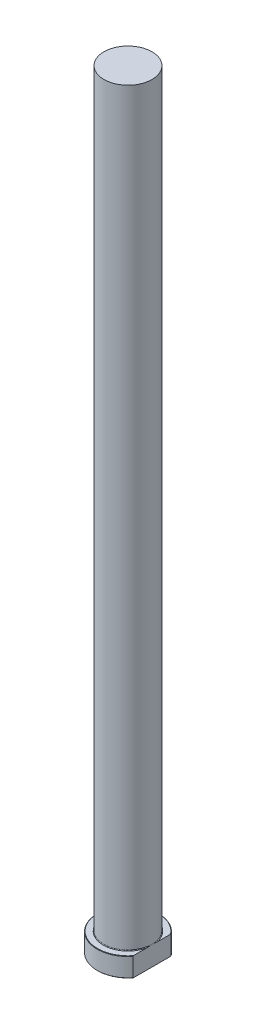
from build123d import *
from build123d.topology import SkipClean

# Parameters (mm, degrees)
CHAMFER1_SIZE = 0.2
FILLET1_R     = 0.3
KEY_DEPTH     = 401.639488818


with BuildPart() as part:
    # Sketch1 → Revolve1 (revolve)
    with BuildSketch(Plane.XY, mode=Mode.PRIVATE) as revolve1_sk:
        Polygon((0, 0), (-16, 0), (-16, 10), (-12.5, 10), (-12.5, 400), (0, 400), align=None)
    revolve(revolve1_sk.sketch.rotate(Axis((0, 259.958771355, 0), (0, -1, 0)), 270), axis=Axis((0, 259.958771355, 0), (0, -1, 0)))

    # Chamfer1
    chamfer1_edges = [part.edges().sort_by_distance(p)[0] for p in [
        (0, 10, -16),
        (0, 0, -16),
    ]]
    chamfer(chamfer1_edges, length=CHAMFER1_SIZE)

    # Fillet1
    fillet1_edges = [part.edges().sort_by_distance(p)[0] for p in [
        (0, 10, -12.5),
    ]]
    fillet(fillet1_edges, radius=FILLET1_R)

    # Sketch2 → KEY (cut, through all)
    with SkipClean():  # the faces are left unmerged after this step: merging them gives an invalid solid
        with BuildSketch(Plane(origin=(0, 0, 0), x_dir=(1, 0, 0), z_dir=(0, 1, 0))):
            with BuildLine():
                Line((12.5, 9.987492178), (12.5, -9.987492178))
                ThreePointArc((12.5, -9.987492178), (16, 0), (12.5, 9.987492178))
            make_face()
        extrude(amount=KEY_DEPTH, mode=Mode.SUBTRACT)


solid = part.part
